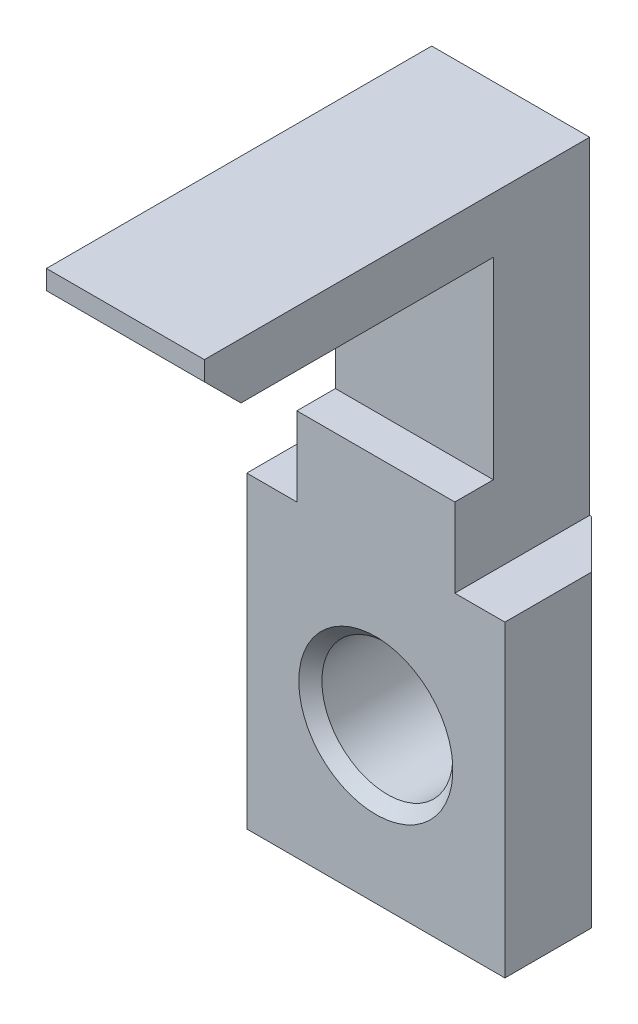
ISO-10303-21;
HEADER;
FILE_DESCRIPTION(('STEP AP214'),'2;1');
FILE_NAME('part.step','',(''),(''),'','','');
FILE_SCHEMA(('AUTOMOTIVE_DESIGN { 1 0 10303 214 1 1 1 1 }'));
ENDSEC;
DATA;
#1=APPLICATION_CONTEXT('core data for automotive mechanical design processes');
#2=APPLICATION_PROTOCOL_DEFINITION('international standard','automotive_design',2000,#1);
#3=PRODUCT_CONTEXT('',#1,'mechanical');
#4=PRODUCT('Part','Part','',(#3));
#5=PRODUCT_RELATED_PRODUCT_CATEGORY('part','',(#4));
#6=PRODUCT_DEFINITION_FORMATION('','',#4);
#7=PRODUCT_DEFINITION_CONTEXT('part definition',#1,'design');
#8=PRODUCT_DEFINITION('design','',#6,#7);
#9=PRODUCT_DEFINITION_SHAPE('','',#8);
#10=(LENGTH_UNIT() NAMED_UNIT(*) SI_UNIT(.MILLI.,.METRE.));
#11=(NAMED_UNIT(*) PLANE_ANGLE_UNIT() SI_UNIT($,.RADIAN.));
#12=(NAMED_UNIT(*) SI_UNIT($,.STERADIAN.) SOLID_ANGLE_UNIT());
#13=UNCERTAINTY_MEASURE_WITH_UNIT(LENGTH_MEASURE(1.E-05),#10,'distance_accuracy_value','');
#14=(GEOMETRIC_REPRESENTATION_CONTEXT(3) GLOBAL_UNCERTAINTY_ASSIGNED_CONTEXT((#13)) GLOBAL_UNIT_ASSIGNED_CONTEXT((#10,
#11,#12)) REPRESENTATION_CONTEXT('',''));
#15=CARTESIAN_POINT('',(0.,0.,0.));
#16=DIRECTION('',(0.,0.,1.));
#17=DIRECTION('',(1.,0.,0.));
#18=AXIS2_PLACEMENT_3D('',#15,#16,#17);
#19=CARTESIAN_POINT('',(1.07675850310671E-06,22.1000000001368,6.50000000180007));
#20=DIRECTION('',(0.,-1.,0.));
#21=DIRECTION('',(0.,0.,-1.));
#22=AXIS2_PLACEMENT_3D('',#19,#20,#21);
#23=CONICAL_SURFACE('',#22,1.99999999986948,0.785398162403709);
#24=CARTESIAN_POINT('',(1.07684172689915E-06,24.1000000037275,6.50000000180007));
#25=VERTEX_POINT('',#24);
#26=VERTEX_LOOP('',#25);
#27=FACE_BOUND('',#26,.T.);
#28=CARTESIAN_POINT('',(1.07675850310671E-06,22.1000000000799,6.50000000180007));
#29=DIRECTION('',(0.,-1.,0.));
#30=DIRECTION('',(0.,0.,-1.));
#31=AXIS2_PLACEMENT_3D('',#28,#29,#30);
#32=CIRCLE('',#31,1.99999999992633);
#33=CARTESIAN_POINT('',(1.07675850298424E-06,22.1000000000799,4.50000000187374));
#34=VERTEX_POINT('',#33);
#35=EDGE_CURVE('E36',#34,#34,#32,.T.);
#36=ORIENTED_EDGE('',*,*,#35,.T.);
#37=EDGE_LOOP('',(#36));
#38=FACE_BOUND('',#37,.T.);
#39=ADVANCED_FACE('F15',(#27,#38),#23,.F.);
#40=CARTESIAN_POINT('',(1.07675850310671E-06,0.,2.04636307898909E-09));
#41=DIRECTION('',(0.,0.,1.));
#42=DIRECTION('',(1.,0.,0.));
#43=AXIS2_PLACEMENT_3D('',#40,#41,#42);
#44=CONICAL_SURFACE('',#43,3.99999999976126,0.785398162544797);
#45=CARTESIAN_POINT('',(1.076758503E-06,0.,-0.599999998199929));
#46=DIRECTION('',(0.,0.,-1.));
#47=DIRECTION('',(-1.,0.,0.));
#48=AXIS2_PLACEMENT_3D('',#45,#46,#47);
#49=CIRCLE('',#48,3.4);
#50=CARTESIAN_POINT('',(-3.39999892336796,0.,-0.599999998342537));
#51=VERTEX_POINT('',#50);
#52=EDGE_CURVE('E242',#51,#51,#49,.T.);
#53=ORIENTED_EDGE('',*,*,#52,.T.);
#54=EDGE_LOOP('',(#53));
#55=FACE_BOUND('',#54,.T.);
#56=CARTESIAN_POINT('',(1.07675850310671E-06,0.,2.04636307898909E-09));
#57=DIRECTION('',(0.,0.,1.));
#58=DIRECTION('',(1.,0.,0.));
#59=AXIS2_PLACEMENT_3D('',#56,#57,#58);
#60=CIRCLE('',#59,3.99999999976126);
#61=CARTESIAN_POINT('',(-3.99999892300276,0.,2.04636307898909E-09));
#62=VERTEX_POINT('',#61);
#63=EDGE_CURVE('E18',#62,#62,#60,.T.);
#64=ORIENTED_EDGE('',*,*,#63,.T.);
#65=EDGE_LOOP('',(#64));
#66=FACE_BOUND('',#65,.T.);
#67=ADVANCED_FACE('F284',(#55,#66),#44,.F.);
#68=CARTESIAN_POINT('',(-6.69999892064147,7.99999999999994,-16.3590585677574));
#69=DIRECTION('',(0.,1.,0.));
#70=DIRECTION('',(0.,0.,1.));
#71=AXIS2_PLACEMENT_3D('',#68,#69,#70);
#72=PLANE('',#71);
#73=DIRECTION('',(0.,0.,1.));
#74=VECTOR('',#73,1.);
#75=CARTESIAN_POINT('',(-6.69999892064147,7.99999999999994,-10.4999999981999));
#76=LINE('',#75,#74);
#77=CARTESIAN_POINT('',(-6.69999892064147,7.99999999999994,1.80006666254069E-09));
#78=VERTEX_POINT('',#77);
#79=CARTESIAN_POINT('',(-6.69999892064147,7.99999999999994,-4.49999999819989));
#80=VERTEX_POINT('',#79);
#81=EDGE_CURVE('E277',#78,#80,#76,.F.);
#82=ORIENTED_EDGE('',*,*,#81,.F.);
#83=DIRECTION('',(-1.,0.,0.));
#84=VECTOR('',#83,1.);
#85=CARTESIAN_POINT('',(-4.09999892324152,7.99999999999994,1.800069E-09));
#86=LINE('',#85,#84);
#87=CARTESIAN_POINT('',(-4.09999892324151,7.99999999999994,1.80006449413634E-09));
#88=VERTEX_POINT('',#87);
#89=EDGE_CURVE('E269',#78,#88,#86,.F.);
#90=ORIENTED_EDGE('',*,*,#89,.T.);
#91=DIRECTION('',(0.,0.,1.));
#92=VECTOR('',#91,1.);
#93=CARTESIAN_POINT('',(-4.09999892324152,7.99999999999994,12.2500000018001));
#94=LINE('',#93,#92);
#95=CARTESIAN_POINT('',(-4.09999892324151,7.99999999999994,-6.99999999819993));
#96=VERTEX_POINT('',#95);
#97=EDGE_CURVE('E240',#96,#88,#94,.T.);
#98=ORIENTED_EDGE('',*,*,#97,.F.);
#99=DIRECTION('',(1.,0.,0.));
#100=VECTOR('',#99,1.);
#101=CARTESIAN_POINT('',(-6.69999892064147,7.99999999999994,-6.99999999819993));
#102=LINE('',#101,#100);
#103=CARTESIAN_POINT('',(-4.1999989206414,7.99999999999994,-6.99999999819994));
#104=VERTEX_POINT('',#103);
#105=EDGE_CURVE('E279',#96,#104,#102,.F.);
#106=ORIENTED_EDGE('',*,*,#105,.T.);
#107=DIRECTION('',(0.707106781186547,0.,-0.707106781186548));
#108=VECTOR('',#107,1.);
#109=CARTESIAN_POINT('',(-7.25749600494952,7.99999999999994,-3.94250291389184));
#110=LINE('',#109,#108);
#111=EDGE_CURVE('E220',#104,#80,#110,.F.);
#112=ORIENTED_EDGE('',*,*,#111,.T.);
#113=EDGE_LOOP('',(#82,#90,#98,#106,#112));
#114=FACE_BOUND('',#113,.T.);
#115=ADVANCED_FACE('F290',(#114),#72,.T.);
#116=CARTESIAN_POINT('',(-6.69999892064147,10.,-10.4999999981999));
#117=DIRECTION('',(-1.,0.,0.));
#118=DIRECTION('',(0.,0.,1.));
#119=AXIS2_PLACEMENT_3D('',#116,#117,#118);
#120=PLANE('',#119);
#121=DIRECTION('',(0.,1.,0.));
#122=VECTOR('',#121,1.);
#123=CARTESIAN_POINT('',(-6.69999892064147,7.74038006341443,-4.49999999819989));
#124=LINE('',#123,#122);
#125=CARTESIAN_POINT('',(-6.69999892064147,-8.,-4.49999999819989));
#126=VERTEX_POINT('',#125);
#127=EDGE_CURVE('E223',#80,#126,#124,.F.);
#128=ORIENTED_EDGE('',*,*,#127,.T.);
#129=DIRECTION('',(0.,0.,-1.));
#130=VECTOR('',#129,1.);
#131=CARTESIAN_POINT('',(-6.69999892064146,-8.,-7.99999999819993));
#132=LINE('',#131,#130);
#133=CARTESIAN_POINT('',(-6.69999892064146,-8.,1.80006888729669E-09));
#134=VERTEX_POINT('',#133);
#135=EDGE_CURVE('E215',#134,#126,#132,.T.);
#136=ORIENTED_EDGE('',*,*,#135,.F.);
#137=DIRECTION('',(0.,1.,0.));
#138=VECTOR('',#137,1.);
#139=CARTESIAN_POINT('',(-6.69999892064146,8.,1.800069E-09));
#140=LINE('',#139,#138);
#141=EDGE_CURVE('E272',#134,#78,#140,.T.);
#142=ORIENTED_EDGE('',*,*,#141,.T.);
#143=ORIENTED_EDGE('',*,*,#81,.T.);
#144=EDGE_LOOP('',(#128,#136,#142,#143));
#145=FACE_BOUND('',#144,.T.);
#146=ADVANCED_FACE('F355',(#145),#120,.T.);
#147=CARTESIAN_POINT('',(6.70000107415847,10.,-10.4999999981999));
#148=DIRECTION('',(-1.,0.,0.));
#149=DIRECTION('',(0.,0.,1.));
#150=AXIS2_PLACEMENT_3D('',#147,#148,#149);
#151=PLANE('',#150);
#152=DIRECTION('',(0.,0.,-1.));
#153=VECTOR('',#152,1.);
#154=CARTESIAN_POINT('',(6.70000107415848,-8.,-7.99999999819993));
#155=LINE('',#154,#153);
#156=CARTESIAN_POINT('',(6.70000107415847,-8.,-4.49999999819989));
#157=VERTEX_POINT('',#156);
#158=CARTESIAN_POINT('',(6.70000107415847,-8.,1.80006888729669E-09));
#159=VERTEX_POINT('',#158);
#160=EDGE_CURVE('E210',#157,#159,#155,.F.);
#161=ORIENTED_EDGE('',*,*,#160,.F.);
#162=DIRECTION('',(0.,1.,0.));
#163=VECTOR('',#162,1.);
#164=CARTESIAN_POINT('',(6.70000107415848,7.74038006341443,-4.4999999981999));
#165=LINE('',#164,#163);
#166=CARTESIAN_POINT('',(6.70000107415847,7.99999999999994,-4.49999999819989));
#167=VERTEX_POINT('',#166);
#168=EDGE_CURVE('E205',#167,#157,#165,.F.);
#169=ORIENTED_EDGE('',*,*,#168,.F.);
#170=DIRECTION('',(0.,0.,-1.));
#171=VECTOR('',#170,1.);
#172=CARTESIAN_POINT('',(6.70000107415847,7.99999999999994,-16.3590585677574));
#173=LINE('',#172,#171);
#174=CARTESIAN_POINT('',(6.70000107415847,7.99999999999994,1.80006666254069E-09));
#175=VERTEX_POINT('',#174);
#176=EDGE_CURVE('E253',#167,#175,#173,.F.);
#177=ORIENTED_EDGE('',*,*,#176,.T.);
#178=DIRECTION('',(0.,1.,0.));
#179=VECTOR('',#178,1.);
#180=CARTESIAN_POINT('',(6.70000107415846,8.,1.800069E-09));
#181=LINE('',#180,#179);
#182=EDGE_CURVE('E275',#175,#159,#181,.F.);
#183=ORIENTED_EDGE('',*,*,#182,.T.);
#184=EDGE_LOOP('',(#161,#169,#177,#183));
#185=FACE_BOUND('',#184,.T.);
#186=ADVANCED_FACE('F352',(#185),#151,.F.);
#187=CARTESIAN_POINT('',(-4.09999892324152,8.,1.800069E-09));
#188=DIRECTION('',(0.,0.,-1.));
#189=DIRECTION('',(-1.,0.,0.));
#190=AXIS2_PLACEMENT_3D('',#187,#188,#189);
#191=PLANE('',#190);
#192=ORIENTED_EDGE('',*,*,#63,.F.);
#193=EDGE_LOOP('',(#192));
#194=FACE_BOUND('',#193,.T.);
#195=DIRECTION('',(1.,0.,0.));
#196=VECTOR('',#195,1.);
#197=CARTESIAN_POINT('',(6.1944365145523,12.1,1.80006920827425E-09));
#198=LINE('',#197,#196);
#199=CARTESIAN_POINT('',(-4.09999892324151,12.1,1.80006899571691E-09));
#200=VERTEX_POINT('',#199);
#201=CARTESIAN_POINT('',(4.10000107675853,12.1,1.80006899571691E-09));
#202=VERTEX_POINT('',#201);
#203=EDGE_CURVE('E267',#200,#202,#198,.T.);
#204=ORIENTED_EDGE('',*,*,#203,.F.);
#205=DIRECTION('',(0.,1.,0.));
#206=VECTOR('',#205,1.);
#207=CARTESIAN_POINT('',(-4.09999892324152,24.6666666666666,1.80006877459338E-09));
#208=LINE('',#207,#206);
#209=EDGE_CURVE('E238',#88,#200,#208,.T.);
#210=ORIENTED_EDGE('',*,*,#209,.F.);
#211=ORIENTED_EDGE('',*,*,#89,.F.);
#212=ORIENTED_EDGE('',*,*,#141,.F.);
#213=DIRECTION('',(1.,0.,0.));
#214=VECTOR('',#213,1.);
#215=CARTESIAN_POINT('',(6.70000107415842,-8.,1.80006877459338E-09));
#216=LINE('',#215,#214);
#217=EDGE_CURVE('E217',#159,#134,#216,.F.);
#218=ORIENTED_EDGE('',*,*,#217,.F.);
#219=ORIENTED_EDGE('',*,*,#182,.F.);
#220=DIRECTION('',(1.,0.,0.));
#221=VECTOR('',#220,1.);
#222=CARTESIAN_POINT('',(6.70000107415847,7.99999999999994,1.800060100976E-09));
#223=LINE('',#222,#221);
#224=CARTESIAN_POINT('',(4.10000107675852,7.99999999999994,1.80006671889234E-09));
#225=VERTEX_POINT('',#224);
#226=EDGE_CURVE('E250',#175,#225,#223,.F.);
#227=ORIENTED_EDGE('',*,*,#226,.T.);
#228=DIRECTION('',(0.,1.,0.));
#229=VECTOR('',#228,1.);
#230=CARTESIAN_POINT('',(4.10000107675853,24.6666666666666,1.80006877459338E-09));
#231=LINE('',#230,#229);
#232=EDGE_CURVE('E200',#225,#202,#231,.T.);
#233=ORIENTED_EDGE('',*,*,#232,.T.);
#234=EDGE_LOOP('',(#204,#210,#211,#212,#218,#219,#227,#233));
#235=FACE_BOUND('',#234,.T.);
#236=ADVANCED_FACE('F348',(#194,#235),#191,.F.);
#237=CARTESIAN_POINT('',(6.1944365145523,12.1,-1.99999999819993));
#238=DIRECTION('',(0.,1.,0.));
#239=DIRECTION('',(0.,0.,1.));
#240=AXIS2_PLACEMENT_3D('',#237,#238,#239);
#241=PLANE('',#240);
#242=DIRECTION('',(1.,0.,0.));
#243=VECTOR('',#242,1.);
#244=CARTESIAN_POINT('',(6.1944365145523,12.1,-1.99999999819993));
#245=LINE('',#244,#243);
#246=CARTESIAN_POINT('',(-4.09999892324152,12.1,-1.99999999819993));
#247=VERTEX_POINT('',#246);
#248=CARTESIAN_POINT('',(4.10000107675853,12.1,-1.99999999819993));
#249=VERTEX_POINT('',#248);
#250=EDGE_CURVE('E265',#247,#249,#245,.T.);
#251=ORIENTED_EDGE('',*,*,#250,.F.);
#252=DIRECTION('',(0.,0.,1.));
#253=VECTOR('',#252,1.);
#254=CARTESIAN_POINT('',(-4.09999892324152,12.1,12.2500000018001));
#255=LINE('',#254,#253);
#256=EDGE_CURVE('E236',#200,#247,#255,.F.);
#257=ORIENTED_EDGE('',*,*,#256,.F.);
#258=ORIENTED_EDGE('',*,*,#203,.T.);
#259=DIRECTION('',(0.,0.,1.));
#260=VECTOR('',#259,1.);
#261=CARTESIAN_POINT('',(4.10000107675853,12.1,12.2500000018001));
#262=LINE('',#261,#260);
#263=EDGE_CURVE('E197',#202,#249,#262,.F.);
#264=ORIENTED_EDGE('',*,*,#263,.T.);
#265=EDGE_LOOP('',(#251,#257,#258,#264));
#266=FACE_BOUND('',#265,.T.);
#267=ADVANCED_FACE('F344',(#266),#241,.T.);
#268=CARTESIAN_POINT('',(6.1944365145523,20.5,-1.99999999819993));
#269=DIRECTION('',(0.,0.,1.));
#270=DIRECTION('',(1.,0.,0.));
#271=AXIS2_PLACEMENT_3D('',#268,#269,#270);
#272=PLANE('',#271);
#273=DIRECTION('',(1.,0.,0.));
#274=VECTOR('',#273,1.);
#275=CARTESIAN_POINT('',(-2.67199606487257,22.1,-1.99999999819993));
#276=LINE('',#275,#274);
#277=CARTESIAN_POINT('',(4.10000107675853,22.1,-1.99999999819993));
#278=VERTEX_POINT('',#277);
#279=CARTESIAN_POINT('',(-4.09999892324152,22.1,-1.99999999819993));
#280=VERTEX_POINT('',#279);
#281=EDGE_CURVE('E262',#278,#280,#276,.F.);
#282=ORIENTED_EDGE('',*,*,#281,.T.);
#283=DIRECTION('',(0.,1.,0.));
#284=VECTOR('',#283,1.);
#285=CARTESIAN_POINT('',(-4.09999892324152,24.6666666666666,-1.99999999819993));
#286=LINE('',#285,#284);
#287=EDGE_CURVE('E234',#247,#280,#286,.T.);
#288=ORIENTED_EDGE('',*,*,#287,.F.);
#289=ORIENTED_EDGE('',*,*,#250,.T.);
#290=DIRECTION('',(0.,1.,0.));
#291=VECTOR('',#290,1.);
#292=CARTESIAN_POINT('',(4.10000107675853,24.6666666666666,-1.99999999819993));
#293=LINE('',#292,#291);
#294=EDGE_CURVE('E194',#249,#278,#293,.T.);
#295=ORIENTED_EDGE('',*,*,#294,.T.);
#296=EDGE_LOOP('',(#282,#288,#289,#295));
#297=FACE_BOUND('',#296,.T.);
#298=ADVANCED_FACE('F341',(#297),#272,.T.);
#299=CARTESIAN_POINT('',(-2.67199606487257,22.1,10.6316969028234));
#300=DIRECTION('',(0.,1.,0.));
#301=DIRECTION('',(0.,0.,1.));
#302=AXIS2_PLACEMENT_3D('',#299,#300,#301);
#303=PLANE('',#302);
#304=ORIENTED_EDGE('',*,*,#35,.F.);
#305=EDGE_LOOP('',(#304));
#306=FACE_BOUND('',#305,.T.);
#307=DIRECTION('',(0.,0.,1.));
#308=VECTOR('',#307,1.);
#309=CARTESIAN_POINT('',(4.10000107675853,22.1,12.2500000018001));
#310=LINE('',#309,#308);
#311=CARTESIAN_POINT('',(4.10000107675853,22.1,11.1000000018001));
#312=VERTEX_POINT('',#311);
#313=EDGE_CURVE('E191',#278,#312,#310,.T.);
#314=ORIENTED_EDGE('',*,*,#313,.T.);
#315=DIRECTION('',(1.,0.,0.));
#316=VECTOR('',#315,1.);
#317=CARTESIAN_POINT('',(-4.09999892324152,22.1,11.1000000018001));
#318=LINE('',#317,#316);
#319=CARTESIAN_POINT('',(-4.09999892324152,22.1,11.1000000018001));
#320=VERTEX_POINT('',#319);
#321=EDGE_CURVE('E258',#312,#320,#318,.F.);
#322=ORIENTED_EDGE('',*,*,#321,.T.);
#323=DIRECTION('',(0.,0.,1.));
#324=VECTOR('',#323,1.);
#325=CARTESIAN_POINT('',(-4.09999892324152,22.1,12.2500000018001));
#326=LINE('',#325,#324);
#327=EDGE_CURVE('E231',#280,#320,#326,.T.);
#328=ORIENTED_EDGE('',*,*,#327,.F.);
#329=ORIENTED_EDGE('',*,*,#281,.F.);
#330=EDGE_LOOP('',(#314,#322,#328,#329));
#331=FACE_BOUND('',#330,.T.);
#332=ADVANCED_FACE('F337',(#306,#331),#303,.F.);
#333=CARTESIAN_POINT('',(-4.09999892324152,22.25,11.2500000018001));
#334=DIRECTION('',(0.,0.707106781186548,-0.707106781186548));
#335=DIRECTION('',(0.,0.707106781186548,0.707106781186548));
#336=AXIS2_PLACEMENT_3D('',#333,#334,#335);
#337=PLANE('',#336);
#338=DIRECTION('',(0.,0.707106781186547,0.707106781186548));
#339=VECTOR('',#338,1.);
#340=CARTESIAN_POINT('',(4.10000107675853,22.1,11.1000000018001));
#341=LINE('',#340,#339);
#342=CARTESIAN_POINT('',(4.10000107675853,24.,13.0000000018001));
#343=VERTEX_POINT('',#342);
#344=EDGE_CURVE('E188',#312,#343,#341,.T.);
#345=ORIENTED_EDGE('',*,*,#344,.T.);
#346=DIRECTION('',(-1.,0.,0.));
#347=VECTOR('',#346,1.);
#348=CARTESIAN_POINT('',(-4.09999892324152,24.,13.0000000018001));
#349=LINE('',#348,#347);
#350=CARTESIAN_POINT('',(-4.09999892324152,24.,13.0000000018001));
#351=VERTEX_POINT('',#350);
#352=EDGE_CURVE('E245',#343,#351,#349,.T.);
#353=ORIENTED_EDGE('',*,*,#352,.T.);
#354=DIRECTION('',(0.,0.707106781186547,0.707106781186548));
#355=VECTOR('',#354,1.);
#356=CARTESIAN_POINT('',(-4.09999892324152,22.1,11.1000000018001));
#357=LINE('',#356,#355);
#358=EDGE_CURVE('E228',#320,#351,#357,.T.);
#359=ORIENTED_EDGE('',*,*,#358,.F.);
#360=ORIENTED_EDGE('',*,*,#321,.F.);
#361=EDGE_LOOP('',(#345,#353,#359,#360));
#362=FACE_BOUND('',#361,.T.);
#363=ADVANCED_FACE('F333',(#362),#337,.F.);
#364=CARTESIAN_POINT('',(6.70000107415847,7.99999999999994,-16.3590585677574));
#365=DIRECTION('',(0.,-1.,0.));
#366=DIRECTION('',(0.,0.,-1.));
#367=AXIS2_PLACEMENT_3D('',#364,#365,#366);
#368=PLANE('',#367);
#369=ORIENTED_EDGE('',*,*,#226,.F.);
#370=ORIENTED_EDGE('',*,*,#176,.F.);
#371=DIRECTION('',(-0.707106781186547,0.,-0.707106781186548));
#372=VECTOR('',#371,1.);
#373=CARTESIAN_POINT('',(7.25749815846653,7.99999999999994,-3.94250291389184));
#374=LINE('',#373,#372);
#375=CARTESIAN_POINT('',(4.20000107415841,7.99999999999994,-6.99999999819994));
#376=VERTEX_POINT('',#375);
#377=EDGE_CURVE('E207',#376,#167,#374,.F.);
#378=ORIENTED_EDGE('',*,*,#377,.F.);
#379=DIRECTION('',(1.,0.,0.));
#380=VECTOR('',#379,1.);
#381=CARTESIAN_POINT('',(6.70000107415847,7.99999999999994,-6.99999999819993));
#382=LINE('',#381,#380);
#383=CARTESIAN_POINT('',(4.10000107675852,7.99999999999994,-6.99999999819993));
#384=VERTEX_POINT('',#383);
#385=EDGE_CURVE('E256',#384,#376,#382,.T.);
#386=ORIENTED_EDGE('',*,*,#385,.F.);
#387=DIRECTION('',(0.,0.,1.));
#388=VECTOR('',#387,1.);
#389=CARTESIAN_POINT('',(4.10000107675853,7.99999999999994,12.2500000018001));
#390=LINE('',#389,#388);
#391=EDGE_CURVE('E164',#384,#225,#390,.T.);
#392=ORIENTED_EDGE('',*,*,#391,.T.);
#393=EDGE_LOOP('',(#369,#370,#378,#386,#392));
#394=FACE_BOUND('',#393,.T.);
#395=ADVANCED_FACE('F329',(#394),#368,.F.);
#396=CARTESIAN_POINT('',(-4.09999892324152,25.,13.0000000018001));
#397=DIRECTION('',(0.,0.,-1.));
#398=DIRECTION('',(-1.,0.,0.));
#399=AXIS2_PLACEMENT_3D('',#396,#397,#398);
#400=PLANE('',#399);
#401=DIRECTION('',(0.,1.,0.));
#402=VECTOR('',#401,1.);
#403=CARTESIAN_POINT('',(4.10000107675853,24.6666666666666,13.0000000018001));
#404=LINE('',#403,#402);
#405=CARTESIAN_POINT('',(4.10000107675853,25.,13.0000000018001));
#406=VERTEX_POINT('',#405);
#407=EDGE_CURVE('E186',#343,#406,#404,.T.);
#408=ORIENTED_EDGE('',*,*,#407,.T.);
#409=DIRECTION('',(1.,0.,0.));
#410=VECTOR('',#409,1.);
#411=CARTESIAN_POINT('',(4.10000107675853,25.,13.0000000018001));
#412=LINE('',#411,#410);
#413=CARTESIAN_POINT('',(-4.09999892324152,25.,13.0000000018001));
#414=VERTEX_POINT('',#413);
#415=EDGE_CURVE('E147',#406,#414,#412,.F.);
#416=ORIENTED_EDGE('',*,*,#415,.T.);
#417=DIRECTION('',(0.,1.,0.));
#418=VECTOR('',#417,1.);
#419=CARTESIAN_POINT('',(-4.09999892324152,24.6666666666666,13.0000000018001));
#420=LINE('',#419,#418);
#421=EDGE_CURVE('E226',#351,#414,#420,.T.);
#422=ORIENTED_EDGE('',*,*,#421,.F.);
#423=ORIENTED_EDGE('',*,*,#352,.F.);
#424=EDGE_LOOP('',(#408,#416,#422,#423));
#425=FACE_BOUND('',#424,.T.);
#426=ADVANCED_FACE('F325',(#425),#400,.F.);
#427=CARTESIAN_POINT('',(1.076758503E-06,0.,-12.5223912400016));
#428=DIRECTION('',(0.,0.,-1.));
#429=DIRECTION('',(-1.,0.,0.));
#430=AXIS2_PLACEMENT_3D('',#427,#428,#429);
#431=CYLINDRICAL_SURFACE('',#430,3.4);
#432=ORIENTED_EDGE('',*,*,#52,.F.);
#433=EDGE_LOOP('',(#432));
#434=FACE_BOUND('',#433,.T.);
#435=CARTESIAN_POINT('',(1.076758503E-06,0.,-6.39999999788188));
#436=DIRECTION('',(0.,0.,-1.));
#437=DIRECTION('',(1.,0.,0.));
#438=AXIS2_PLACEMENT_3D('',#435,#436,#437);
#439=CIRCLE('',#438,3.40000000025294);
#440=CARTESIAN_POINT('',(-3.39999892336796,0.,-6.3999999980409));
#441=VERTEX_POINT('',#440);
#442=EDGE_CURVE('E177',#441,#441,#439,.T.);
#443=ORIENTED_EDGE('',*,*,#442,.T.);
#444=EDGE_LOOP('',(#443));
#445=FACE_BOUND('',#444,.T.);
#446=ADVANCED_FACE('F321',(#434,#445),#431,.F.);
#447=CARTESIAN_POINT('',(-4.09999892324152,24.6666666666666,12.2500000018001));
#448=DIRECTION('',(-1.,0.,0.));
#449=DIRECTION('',(0.,0.,1.));
#450=AXIS2_PLACEMENT_3D('',#447,#448,#449);
#451=PLANE('',#450);
#452=DIRECTION('',(0.,0.,-1.));
#453=VECTOR('',#452,1.);
#454=CARTESIAN_POINT('',(-4.09999892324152,25.,13.0000000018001));
#455=LINE('',#454,#453);
#456=CARTESIAN_POINT('',(-4.09999892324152,25.,-6.99999999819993));
#457=VERTEX_POINT('',#456);
#458=EDGE_CURVE('E151',#414,#457,#455,.T.);
#459=ORIENTED_EDGE('',*,*,#458,.T.);
#460=DIRECTION('',(0.,1.,0.));
#461=VECTOR('',#460,1.);
#462=CARTESIAN_POINT('',(-4.09999892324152,8.81938921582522,-6.99999999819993));
#463=LINE('',#462,#461);
#464=EDGE_CURVE('E158',#457,#96,#463,.F.);
#465=ORIENTED_EDGE('',*,*,#464,.T.);
#466=ORIENTED_EDGE('',*,*,#97,.T.);
#467=ORIENTED_EDGE('',*,*,#209,.T.);
#468=ORIENTED_EDGE('',*,*,#256,.T.);
#469=ORIENTED_EDGE('',*,*,#287,.T.);
#470=ORIENTED_EDGE('',*,*,#327,.T.);
#471=ORIENTED_EDGE('',*,*,#358,.T.);
#472=ORIENTED_EDGE('',*,*,#421,.T.);
#473=EDGE_LOOP('',(#459,#465,#466,#467,#468,#469,#470,#471,#472));
#474=FACE_BOUND('',#473,.T.);
#475=ADVANCED_FACE('F317',(#474),#451,.T.);
#476=CARTESIAN_POINT('',(-7.25749600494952,7.74038006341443,-3.94250291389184));
#477=DIRECTION('',(0.707106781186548,0.,0.707106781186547));
#478=DIRECTION('',(0.707106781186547,0.,-0.707106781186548));
#479=AXIS2_PLACEMENT_3D('',#476,#477,#478);
#480=PLANE('',#479);
#481=DIRECTION('',(0.,1.,0.));
#482=VECTOR('',#481,1.);
#483=CARTESIAN_POINT('',(-4.1999989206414,8.81938921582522,-6.99999999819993));
#484=LINE('',#483,#482);
#485=CARTESIAN_POINT('',(-4.19999892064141,-8.,-6.99999999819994));
#486=VERTEX_POINT('',#485);
#487=EDGE_CURVE('E173',#104,#486,#484,.F.);
#488=ORIENTED_EDGE('',*,*,#487,.T.);
#489=DIRECTION('',(0.707106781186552,0.,-0.707106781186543));
#490=VECTOR('',#489,1.);
#491=CARTESIAN_POINT('',(-6.69999892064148,-8.,-4.49999999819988));
#492=LINE('',#491,#490);
#493=EDGE_CURVE('E213',#126,#486,#492,.T.);
#494=ORIENTED_EDGE('',*,*,#493,.F.);
#495=ORIENTED_EDGE('',*,*,#127,.F.);
#496=ORIENTED_EDGE('',*,*,#111,.F.);
#497=EDGE_LOOP('',(#488,#494,#495,#496));
#498=FACE_BOUND('',#497,.T.);
#499=ADVANCED_FACE('F313',(#498),#480,.F.);
#500=CARTESIAN_POINT('',(6.70000107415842,-8.,-7.99999999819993));
#501=DIRECTION('',(0.,-1.,0.));
#502=DIRECTION('',(0.,0.,-1.));
#503=AXIS2_PLACEMENT_3D('',#500,#501,#502);
#504=PLANE('',#503);
#505=DIRECTION('',(-0.707106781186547,0.,-0.707106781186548));
#506=VECTOR('',#505,1.);
#507=CARTESIAN_POINT('',(7.25749815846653,-8.,-3.94250291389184));
#508=LINE('',#507,#506);
#509=CARTESIAN_POINT('',(4.20000107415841,-8.,-6.99999999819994));
#510=VERTEX_POINT('',#509);
#511=EDGE_CURVE('E203',#157,#510,#508,.T.);
#512=ORIENTED_EDGE('',*,*,#511,.F.);
#513=ORIENTED_EDGE('',*,*,#160,.T.);
#514=ORIENTED_EDGE('',*,*,#217,.T.);
#515=ORIENTED_EDGE('',*,*,#135,.T.);
#516=ORIENTED_EDGE('',*,*,#493,.T.);
#517=DIRECTION('',(1.,0.,0.));
#518=VECTOR('',#517,1.);
#519=CARTESIAN_POINT('',(-0.034772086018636,-8.,-6.99999999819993));
#520=LINE('',#519,#518);
#521=EDGE_CURVE('E168',#486,#510,#520,.T.);
#522=ORIENTED_EDGE('',*,*,#521,.T.);
#523=EDGE_LOOP('',(#512,#513,#514,#515,#516,#522));
#524=FACE_BOUND('',#523,.T.);
#525=ADVANCED_FACE('F309',(#524),#504,.T.);
#526=CARTESIAN_POINT('',(7.25749815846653,7.74038006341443,-3.94250291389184));
#527=DIRECTION('',(0.707106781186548,0.,-0.707106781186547));
#528=DIRECTION('',(-0.707106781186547,0.,-0.707106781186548));
#529=AXIS2_PLACEMENT_3D('',#526,#527,#528);
#530=PLANE('',#529);
#531=ORIENTED_EDGE('',*,*,#511,.T.);
#532=DIRECTION('',(0.,1.,0.));
#533=VECTOR('',#532,1.);
#534=CARTESIAN_POINT('',(4.20000107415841,8.81938921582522,-6.99999999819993));
#535=LINE('',#534,#533);
#536=EDGE_CURVE('E165',#510,#376,#535,.T.);
#537=ORIENTED_EDGE('',*,*,#536,.T.);
#538=ORIENTED_EDGE('',*,*,#377,.T.);
#539=ORIENTED_EDGE('',*,*,#168,.T.);
#540=EDGE_LOOP('',(#531,#537,#538,#539));
#541=FACE_BOUND('',#540,.T.);
#542=ADVANCED_FACE('F306',(#541),#530,.T.);
#543=CARTESIAN_POINT('',(4.10000107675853,24.6666666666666,12.2500000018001));
#544=DIRECTION('',(-1.,0.,0.));
#545=DIRECTION('',(0.,0.,1.));
#546=AXIS2_PLACEMENT_3D('',#543,#544,#545);
#547=PLANE('',#546);
#548=DIRECTION('',(0.,1.,0.));
#549=VECTOR('',#548,1.);
#550=CARTESIAN_POINT('',(4.10000107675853,8.81938921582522,-6.99999999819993));
#551=LINE('',#550,#549);
#552=CARTESIAN_POINT('',(4.10000107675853,25.,-6.99999999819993));
#553=VERTEX_POINT('',#552);
#554=EDGE_CURVE('E156',#384,#553,#551,.T.);
#555=ORIENTED_EDGE('',*,*,#554,.T.);
#556=DIRECTION('',(0.,0.,-1.));
#557=VECTOR('',#556,1.);
#558=CARTESIAN_POINT('',(4.10000107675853,25.,13.0000000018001));
#559=LINE('',#558,#557);
#560=EDGE_CURVE('E142',#553,#406,#559,.F.);
#561=ORIENTED_EDGE('',*,*,#560,.T.);
#562=ORIENTED_EDGE('',*,*,#407,.F.);
#563=ORIENTED_EDGE('',*,*,#344,.F.);
#564=ORIENTED_EDGE('',*,*,#313,.F.);
#565=ORIENTED_EDGE('',*,*,#294,.F.);
#566=ORIENTED_EDGE('',*,*,#263,.F.);
#567=ORIENTED_EDGE('',*,*,#232,.F.);
#568=ORIENTED_EDGE('',*,*,#391,.F.);
#569=EDGE_LOOP('',(#555,#561,#562,#563,#564,#565,#566,#567,#568));
#570=FACE_BOUND('',#569,.T.);
#571=ADVANCED_FACE('F162',(#570),#547,.F.);
#572=CARTESIAN_POINT('',(4.10000107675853,25.,13.0000000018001));
#573=DIRECTION('',(0.,-1.,0.));
#574=DIRECTION('',(0.,0.,-1.));
#575=AXIS2_PLACEMENT_3D('',#572,#573,#574);
#576=PLANE('',#575);
#577=ORIENTED_EDGE('',*,*,#560,.F.);
#578=DIRECTION('',(1.,0.,0.));
#579=VECTOR('',#578,1.);
#580=CARTESIAN_POINT('',(-0.034772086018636,25.,-6.99999999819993));
#581=LINE('',#580,#579);
#582=EDGE_CURVE('E23',#553,#457,#581,.F.);
#583=ORIENTED_EDGE('',*,*,#582,.T.);
#584=ORIENTED_EDGE('',*,*,#458,.F.);
#585=ORIENTED_EDGE('',*,*,#415,.F.);
#586=EDGE_LOOP('',(#577,#583,#584,#585));
#587=FACE_BOUND('',#586,.T.);
#588=ADVANCED_FACE('F144',(#587),#576,.F.);
#589=CARTESIAN_POINT('',(1.07675850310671E-06,0.,-6.99999999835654));
#590=DIRECTION('',(0.,0.,-1.));
#591=DIRECTION('',(-1.,0.,0.));
#592=AXIS2_PLACEMENT_3D('',#589,#590,#591);
#593=CONICAL_SURFACE('',#592,3.99999999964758,0.785398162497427);
#594=ORIENTED_EDGE('',*,*,#442,.F.);
#595=EDGE_LOOP('',(#594));
#596=FACE_BOUND('',#595,.T.);
#597=CARTESIAN_POINT('',(1.07675850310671E-06,0.,-6.99999999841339));
#598=DIRECTION('',(0.,0.,-1.));
#599=DIRECTION('',(-1.,0.,0.));
#600=AXIS2_PLACEMENT_3D('',#597,#598,#599);
#601=CIRCLE('',#600,3.99999999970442);
#602=CARTESIAN_POINT('',(-3.99999892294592,0.,-6.99999999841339));
#603=VERTEX_POINT('',#602);
#604=EDGE_CURVE('E10',#603,#603,#601,.T.);
#605=ORIENTED_EDGE('',*,*,#604,.T.);
#606=EDGE_LOOP('',(#605));
#607=FACE_BOUND('',#606,.T.);
#608=ADVANCED_FACE('F293',(#596,#607),#593,.F.);
#609=CARTESIAN_POINT('',(-0.034772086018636,8.81938921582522,-6.99999999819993));
#610=DIRECTION('',(0.,0.,1.));
#611=DIRECTION('',(1.,0.,0.));
#612=AXIS2_PLACEMENT_3D('',#609,#610,#611);
#613=PLANE('',#612);
#614=ORIENTED_EDGE('',*,*,#604,.F.);
#615=EDGE_LOOP('',(#614));
#616=FACE_BOUND('',#615,.T.);
#617=ORIENTED_EDGE('',*,*,#554,.F.);
#618=ORIENTED_EDGE('',*,*,#385,.T.);
#619=ORIENTED_EDGE('',*,*,#536,.F.);
#620=ORIENTED_EDGE('',*,*,#521,.F.);
#621=ORIENTED_EDGE('',*,*,#487,.F.);
#622=ORIENTED_EDGE('',*,*,#105,.F.);
#623=ORIENTED_EDGE('',*,*,#464,.F.);
#624=ORIENTED_EDGE('',*,*,#582,.F.);
#625=EDGE_LOOP('',(#617,#618,#619,#620,#621,#622,#623,#624));
#626=FACE_BOUND('',#625,.T.);
#627=ADVANCED_FACE('F155',(#616,#626),#613,.F.);
#628=CLOSED_SHELL('',(#39,#67,#115,#146,#186,#236,#267,#298,#332,#363,#395,#426,#446,#475,#499,
#525,#542,#571,#588,#608,#627));
#629=MANIFOLD_SOLID_BREP('B1',#628);
#630=ADVANCED_BREP_SHAPE_REPRESENTATION('',(#18,#629),#14);
#631=SHAPE_DEFINITION_REPRESENTATION(#9,#630);
ENDSEC;
END-ISO-10303-21;
